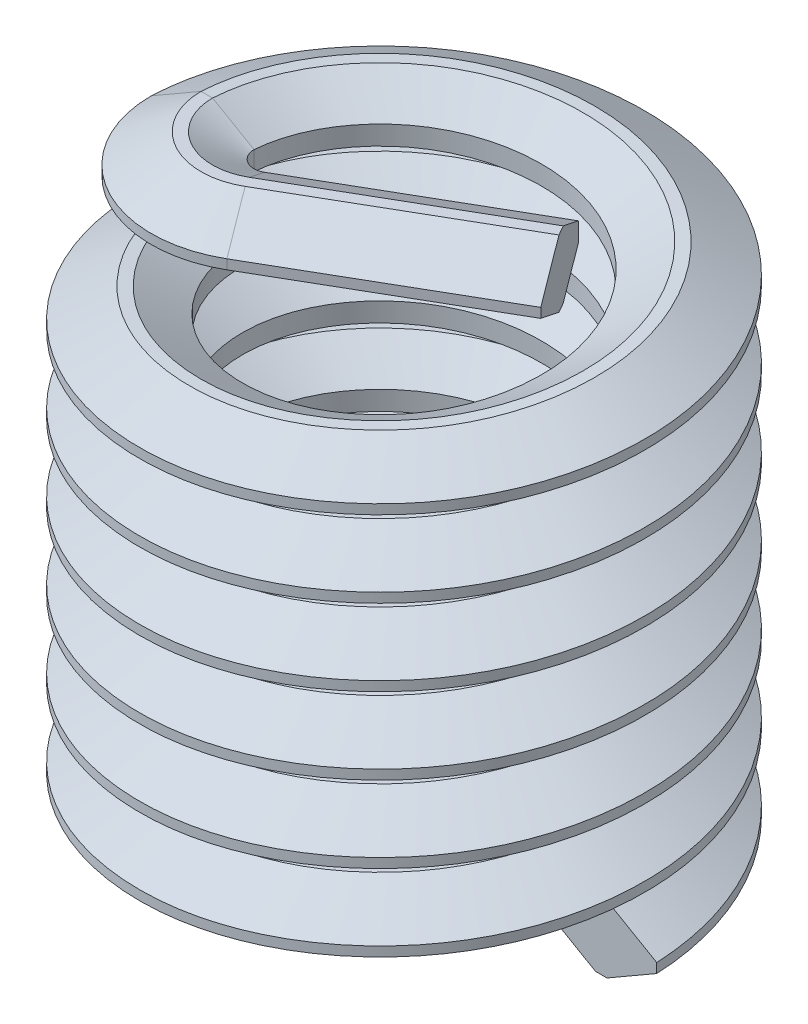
from build123d import *

# Parameters (mm, degrees)
SWEEP1_PITCH       = 1.27
SWEEP1_HEIGHT      = 8.255
SWEEP1_RADIUS      = 3.175
SWEEP1_START_ANGLE = 90
REVOLVE1_ANGLE     = 120
EXTRUDE1_DEPTH     = 3.81


with BuildPart() as part:
    # Sweep1: sweep along a helix
    with BuildLine() as sweep1_path:
        add(Helix(SWEEP1_PITCH, SWEEP1_HEIGHT, SWEEP1_RADIUS, center=(0, 0, 0), direction=(0, 1, 0), mode=Mode.PRIVATE).rotate(Axis((0, 0, 0), (0, 1, 0)), SWEEP1_START_ANGLE))
    # Sketch1 → Sweep1 (sweep)
    with BuildSketch(Plane(origin=(0, 0, 0), x_dir=(-1, 0, 0), z_dir=(0, 0, 1))):
        Polygon((-4.191, -0.079375), (-3.366110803, -0.555625), (-3.175, -0.555625), (-2.487592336, -0.15875), (-2.487592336, 0.15875), (-3.175, 0.555625), (-3.366110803, 0.555625), (-4.191, 0.079375), align=None)
    sweep(path=sweep1_path.line, is_frenet=True)


with BuildPart() as body_2:
    # Sketch3 → Revolve1 (revolve)
    with BuildSketch(Plane.XY):
        Polygon((-3.175, 7.699375), (-2.487592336, 8.09625), (-2.487592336, 8.41375), (-3.175, 8.810625), (-3.366110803, 8.810625), (-4.191, 8.334375), (-4.191, 8.175625), (-3.366110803, 7.699375), align=None)
    revolve(axis=Axis((-2.21262927, 8.255, 0), (0, 1, 0)), revolution_arc=REVOLVE1_ANGLE)

    # Sketch4 → Extrude1 (add)
    with BuildSketch(Plane(origin=(-1.659471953, 0, 0.958096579), x_dir=(-0.500000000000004, 0, -0.8660254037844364), z_dir=(0.8660254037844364, -1.182924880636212e-15, -0.500000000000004))):
        Polygon((-0.047166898, 7.699375), (0.143943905, 7.699375), (0.831351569, 8.09625), (0.831351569, 8.41375), (0.143943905, 8.810625), (-0.047166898, 8.810625), (-0.872056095, 8.334375), (-0.872056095, 8.175625), align=None)
    extrude(amount=EXTRUDE1_DEPTH)


solid = Compound([part.part, body_2.part])
